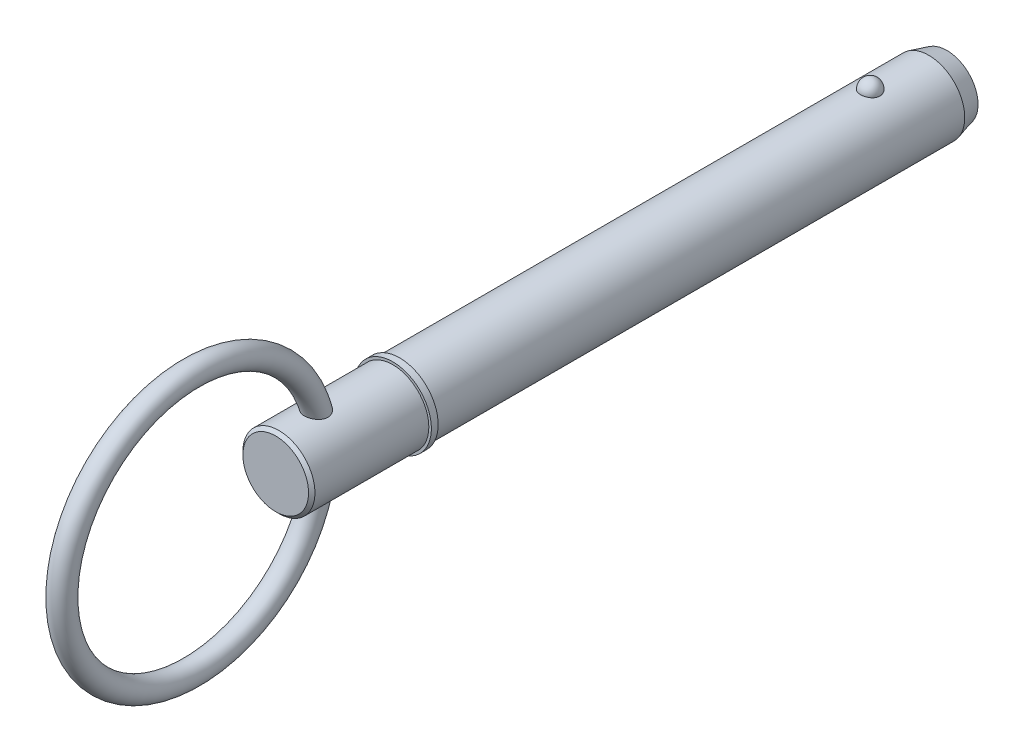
from build123d import *

# Parameters (mm, degrees)
SKETCH2_R           = 7.94
BOSS_EXTRUDE1_DEPTH = 101.6
BOSS_EXTRUDE2_START = 19.05
SKETCH3_R           = 7.94
BOSS_EXTRUDE2_DEPTH = 19.05
CHAMFER1_SIZE       = 4
CHAMFER1_SIZE2      = 1.07179677
SKETCH20_W          = 1.5
SKETCH20_H          = 8.5
SKETCH21_R          = 7.94
BOSS_EXTRUDE3_DEPTH = 27.31
CHAMFER2_SIZE       = 0.7
SKETCH24_R          = 2.5


with BuildPart() as part:
    # Sketch2 → Boss-Extrude1 (new body)
    with BuildSketch(Plane.XY):
        Circle(SKETCH2_R)
    extrude(amount=BOSS_EXTRUDE1_DEPTH)

    # Sketch3 → Boss-Extrude2 (add)
    with BuildSketch(Plane(origin=(0, 0, 0), x_dir=(-1, 0, 0), z_dir=(0, 0, -1)).offset(BOSS_EXTRUDE2_START)):
        Circle(SKETCH3_R)
    extrude(amount=-BOSS_EXTRUDE2_DEPTH)

    # Chamfer1
    chamfer1_edges = [part.edges().sort_by_distance(p)[0] for p in [
        (7.94, 0, -19.05),
    ]]
    chamfer1_side = [part.faces().sort_by_distance(p)[0] for p in [
        (7.94, 0, -9.525),
    ]]
    chamfer(chamfer1_edges, length=CHAMFER1_SIZE, length2=CHAMFER1_SIZE2, reference=chamfer1_side[0])

    # Sketch18 → Revolve1 (revolve)
    with BuildSketch(Plane(origin=(0, 0, 0), x_dir=(0, 0, -1), z_dir=(1, 0, 0))):
        with BuildLine():
            Line((2.15, 10.09), (2.15, 5.79))
            ThreePointArc((2.15, 5.79), (0, 7.94), (2.15, 10.09))
        make_face()
    revolve(axis=Axis((0, 10.09, -2.15), (0, -1, 0)))

    # Sketch20 → Revolve2 (revolve)
    with BuildSketch(Plane(origin=(0, 0, 0), x_dir=(0, 0, -1), z_dir=(1, 0, 0)), mode=Mode.PRIVATE) as revolve2_sk:
        with Locations((-102.35, 4.25)):
            Rectangle(SKETCH20_W, SKETCH20_H)
    revolve(revolve2_sk.sketch.rotate(Axis((0, 0, 33.728787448), (0, 0, 1)), 90), axis=Axis((0, 0, 33.728787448), (0, 0, 1)))

    # Sketch21 → Boss-Extrude3 (add)
    with BuildSketch(Plane(origin=(0, 0, 101.6), x_dir=(-1, 0, 0), z_dir=(0, 0, -1))):
        Circle(SKETCH21_R)
    extrude(amount=-BOSS_EXTRUDE3_DEPTH)

    # Chamfer2
    chamfer2_edges = [part.edges().sort_by_distance(p)[0] for p in [
        (7.94, 0, 128.91),
    ]]
    chamfer(chamfer2_edges, length=CHAMFER2_SIZE)

    # Sweep1: sweep along a path in Sketch23
    with BuildLine(Plane(origin=(0, 0, 0), x_dir=(0, 0, -1), z_dir=(1, 0, 0))) as sweep1_path:
        CenterArc((-147.485, 0), 28.575, 0, 360)
    # Sketch24 → Sweep1 (sweep)
    with BuildSketch(Plane(origin=(0, 0, 0), x_dir=(1, 0, 0), z_dir=(0, 1, 0))):
        with Locations((0, -118.91)):
            Circle(SKETCH24_R)
    sweep(path=sweep1_path.line)


solid = part.part
